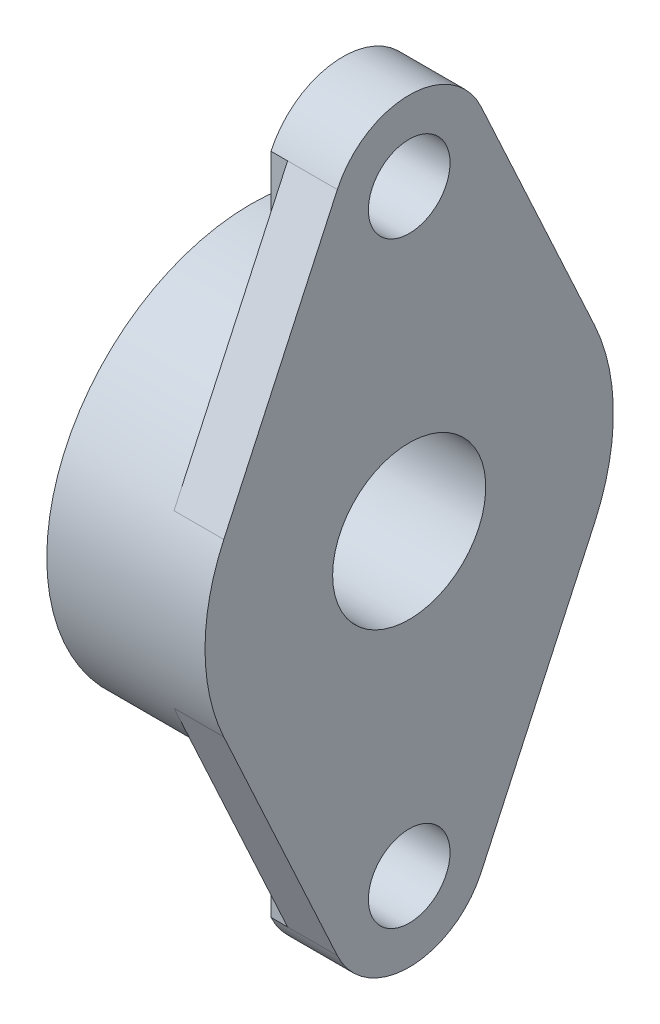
ISO-10303-21;
HEADER;
FILE_DESCRIPTION(('STEP AP214'),'2;1');
FILE_NAME('part.step','',(''),(''),'','','');
FILE_SCHEMA(('AUTOMOTIVE_DESIGN { 1 0 10303 214 1 1 1 1 }'));
ENDSEC;
DATA;
#1=APPLICATION_CONTEXT('core data for automotive mechanical design processes');
#2=APPLICATION_PROTOCOL_DEFINITION('international standard','automotive_design',2000,#1);
#3=PRODUCT_CONTEXT('',#1,'mechanical');
#4=PRODUCT('Part','Part','',(#3));
#5=PRODUCT_RELATED_PRODUCT_CATEGORY('part','',(#4));
#6=PRODUCT_DEFINITION_FORMATION('','',#4);
#7=PRODUCT_DEFINITION_CONTEXT('part definition',#1,'design');
#8=PRODUCT_DEFINITION('design','',#6,#7);
#9=PRODUCT_DEFINITION_SHAPE('','',#8);
#10=(LENGTH_UNIT() NAMED_UNIT(*) SI_UNIT(.MILLI.,.METRE.));
#11=(NAMED_UNIT(*) PLANE_ANGLE_UNIT() SI_UNIT($,.RADIAN.));
#12=(NAMED_UNIT(*) SI_UNIT($,.STERADIAN.) SOLID_ANGLE_UNIT());
#13=UNCERTAINTY_MEASURE_WITH_UNIT(LENGTH_MEASURE(1.E-05),#10,'distance_accuracy_value','');
#14=(GEOMETRIC_REPRESENTATION_CONTEXT(3) GLOBAL_UNCERTAINTY_ASSIGNED_CONTEXT((#13)) GLOBAL_UNIT_ASSIGNED_CONTEXT((#10,
#11,#12)) REPRESENTATION_CONTEXT('',''));
#15=CARTESIAN_POINT('',(0.,0.,0.));
#16=DIRECTION('',(0.,0.,1.));
#17=DIRECTION('',(1.,0.,0.));
#18=AXIS2_PLACEMENT_3D('',#15,#16,#17);
#19=CARTESIAN_POINT('',(-9.75,-65.2808668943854,-36.3230768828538));
#20=DIRECTION('',(-1.,0.,0.));
#21=DIRECTION('',(0.,0.,1.));
#22=AXIS2_PLACEMENT_3D('',#19,#20,#21);
#23=PLANE('',#22);
#24=DIRECTION('',(0.,-1.,0.));
#25=VECTOR('',#24,1.);
#26=CARTESIAN_POINT('',(-9.75,-51.2166303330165,-14.0751922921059));
#27=LINE('',#26,#25);
#28=CARTESIAN_POINT('',(-9.75,-37.4418076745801,-14.0751922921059));
#29=VERTEX_POINT('',#28);
#30=CARTESIAN_POINT('',(-9.75,-64.991452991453,-14.0751922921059));
#31=VERTEX_POINT('',#30);
#32=EDGE_CURVE('E71',#29,#31,#27,.T.);
#33=ORIENTED_EDGE('',*,*,#32,.F.);
#34=CARTESIAN_POINT('',(-9.75,0.,0.));
#35=DIRECTION('',(-1.,0.,0.));
#36=DIRECTION('',(0.,0.,1.));
#37=AXIS2_PLACEMENT_3D('',#34,#35,#36);
#38=CIRCLE('',#37,40.);
#39=CARTESIAN_POINT('',(-9.75,-16.7558025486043,-36.3213861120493));
#40=VERTEX_POINT('',#39);
#41=EDGE_CURVE('E208',#40,#29,#38,.T.);
#42=ORIENTED_EDGE('',*,*,#41,.F.);
#43=DIRECTION('',(0.,0.908076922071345,-0.418803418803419));
#44=VECTOR('',#43,1.);
#45=CARTESIAN_POINT('',(-9.75,-40.8717948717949,-25.1991345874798));
#46=LINE('',#45,#44);
#47=EDGE_CURVE('E308',#31,#40,#46,.T.);
#48=ORIENTED_EDGE('',*,*,#47,.F.);
#49=EDGE_LOOP('',(#33,#42,#48));
#50=FACE_BOUND('',#49,.T.);
#51=ADVANCED_FACE('F16',(#50),#23,.T.);
#52=CARTESIAN_POINT('',(-13.,-64.991452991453,-14.0751922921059));
#53=DIRECTION('',(0.,0.,-1.));
#54=DIRECTION('',(0.,1.,0.));
#55=AXIS2_PLACEMENT_3D('',#52,#53,#54);
#56=PLANE('',#55);
#57=DIRECTION('',(0.,-1.,0.));
#58=VECTOR('',#57,1.);
#59=CARTESIAN_POINT('',(-13.,-55.9036947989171,-14.0751922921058));
#60=LINE('',#59,#58);
#61=CARTESIAN_POINT('',(-13.,-37.4418076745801,-14.0751922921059));
#62=VERTEX_POINT('',#61);
#63=CARTESIAN_POINT('',(-13.,-64.991452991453,-14.0751922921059));
#64=VERTEX_POINT('',#63);
#65=EDGE_CURVE('E65',#62,#64,#60,.T.);
#66=ORIENTED_EDGE('',*,*,#65,.F.);
#67=DIRECTION('',(-1.,0.,0.));
#68=VECTOR('',#67,1.);
#69=CARTESIAN_POINT('',(-15.5,-37.4418076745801,-14.0751922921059));
#70=LINE('',#69,#68);
#71=EDGE_CURVE('E300',#29,#62,#70,.T.);
#72=ORIENTED_EDGE('',*,*,#71,.F.);
#73=ORIENTED_EDGE('',*,*,#32,.T.);
#74=DIRECTION('',(1.,0.,0.));
#75=VECTOR('',#74,1.);
#76=CARTESIAN_POINT('',(-6.5,-64.991452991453,-14.0751922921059));
#77=LINE('',#76,#75);
#78=EDGE_CURVE('E316',#64,#31,#77,.T.);
#79=ORIENTED_EDGE('',*,*,#78,.F.);
#80=EDGE_LOOP('',(#66,#72,#73,#79));
#81=FACE_BOUND('',#80,.T.);
#82=ADVANCED_FACE('F482',(#81),#56,.T.);
#83=CARTESIAN_POINT('',(-9.75,16.4663885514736,-36.3230768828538));
#84=DIRECTION('',(-1.,0.,0.));
#85=DIRECTION('',(0.,0.,1.));
#86=AXIS2_PLACEMENT_3D('',#83,#84,#85);
#87=PLANE('',#86);
#88=CARTESIAN_POINT('',(-9.75,0.,0.));
#89=DIRECTION('',(-1.,0.,0.));
#90=DIRECTION('',(0.,0.,1.));
#91=AXIS2_PLACEMENT_3D('',#88,#89,#90);
#92=CIRCLE('',#91,40.);
#93=CARTESIAN_POINT('',(-9.75,37.4418076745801,-14.0751922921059));
#94=VERTEX_POINT('',#93);
#95=CARTESIAN_POINT('',(-9.75,16.7558025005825,-36.3213861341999));
#96=VERTEX_POINT('',#95);
#97=EDGE_CURVE('E360',#94,#96,#92,.T.);
#98=ORIENTED_EDGE('',*,*,#97,.F.);
#99=DIRECTION('',(0.,-1.,0.));
#100=VECTOR('',#99,1.);
#101=CARTESIAN_POINT('',(-9.75,51.2166303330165,-14.0751922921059));
#102=LINE('',#101,#100);
#103=CARTESIAN_POINT('',(-9.75,64.991452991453,-14.0751922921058));
#104=VERTEX_POINT('',#103);
#105=EDGE_CURVE('E270',#104,#94,#102,.T.);
#106=ORIENTED_EDGE('',*,*,#105,.F.);
#107=DIRECTION('',(0.,0.908076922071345,0.418803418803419));
#108=VECTOR('',#107,1.);
#109=CARTESIAN_POINT('',(-9.75,40.8717948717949,-25.1991345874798));
#110=LINE('',#109,#108);
#111=EDGE_CURVE('E203',#96,#104,#110,.T.);
#112=ORIENTED_EDGE('',*,*,#111,.F.);
#113=EDGE_LOOP('',(#98,#106,#112));
#114=FACE_BOUND('',#113,.T.);
#115=ADVANCED_FACE('F371',(#114),#87,.T.);
#116=CARTESIAN_POINT('',(-13.,37.4418076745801,-14.0751922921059));
#117=DIRECTION('',(0.,0.,-1.));
#118=DIRECTION('',(0.,1.,0.));
#119=AXIS2_PLACEMENT_3D('',#116,#117,#118);
#120=PLANE('',#119);
#121=DIRECTION('',(0.,-1.,0.));
#122=VECTOR('',#121,1.);
#123=CARTESIAN_POINT('',(-13.,55.9036947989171,-14.0751922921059));
#124=LINE('',#123,#122);
#125=CARTESIAN_POINT('',(-13.,64.991452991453,-14.0751922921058));
#126=VERTEX_POINT('',#125);
#127=CARTESIAN_POINT('',(-13.,37.4418076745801,-14.0751922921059));
#128=VERTEX_POINT('',#127);
#129=EDGE_CURVE('E245',#126,#128,#124,.T.);
#130=ORIENTED_EDGE('',*,*,#129,.F.);
#131=DIRECTION('',(-1.,0.,0.));
#132=VECTOR('',#131,1.);
#133=CARTESIAN_POINT('',(-6.5,64.991452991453,-14.0751922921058));
#134=LINE('',#133,#132);
#135=EDGE_CURVE('E197',#104,#126,#134,.T.);
#136=ORIENTED_EDGE('',*,*,#135,.F.);
#137=ORIENTED_EDGE('',*,*,#105,.T.);
#138=DIRECTION('',(1.,0.,0.));
#139=VECTOR('',#138,1.);
#140=CARTESIAN_POINT('',(-15.5,37.4418076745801,-14.0751922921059));
#141=LINE('',#140,#139);
#142=EDGE_CURVE('E215',#128,#94,#141,.T.);
#143=ORIENTED_EDGE('',*,*,#142,.F.);
#144=EDGE_LOOP('',(#130,#136,#137,#143));
#145=FACE_BOUND('',#144,.T.);
#146=ADVANCED_FACE('F366',(#145),#120,.T.);
#147=CARTESIAN_POINT('',(-13.,-37.4418076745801,14.0751922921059));
#148=DIRECTION('',(0.,0.,1.));
#149=DIRECTION('',(0.,-1.,0.));
#150=AXIS2_PLACEMENT_3D('',#147,#148,#149);
#151=PLANE('',#150);
#152=DIRECTION('',(0.,1.,0.));
#153=VECTOR('',#152,1.);
#154=CARTESIAN_POINT('',(-13.,-55.9036947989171,14.0751922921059));
#155=LINE('',#154,#153);
#156=CARTESIAN_POINT('',(-13.,-64.991452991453,14.0751922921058));
#157=VERTEX_POINT('',#156);
#158=CARTESIAN_POINT('',(-13.,-37.4418076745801,14.0751922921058));
#159=VERTEX_POINT('',#158);
#160=EDGE_CURVE('E59',#157,#159,#155,.T.);
#161=ORIENTED_EDGE('',*,*,#160,.F.);
#162=DIRECTION('',(-1.,0.,0.));
#163=VECTOR('',#162,1.);
#164=CARTESIAN_POINT('',(-6.5,-64.991452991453,14.0751922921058));
#165=LINE('',#164,#163);
#166=CARTESIAN_POINT('',(-9.75,-64.991452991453,14.0751922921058));
#167=VERTEX_POINT('',#166);
#168=EDGE_CURVE('E257',#167,#157,#165,.T.);
#169=ORIENTED_EDGE('',*,*,#168,.F.);
#170=DIRECTION('',(0.,1.,0.));
#171=VECTOR('',#170,1.);
#172=CARTESIAN_POINT('',(-9.75,-64.991452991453,14.0751922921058));
#173=LINE('',#172,#171);
#174=CARTESIAN_POINT('',(-9.75,-37.4418076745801,14.0751922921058));
#175=VERTEX_POINT('',#174);
#176=EDGE_CURVE('E251',#175,#167,#173,.F.);
#177=ORIENTED_EDGE('',*,*,#176,.F.);
#178=DIRECTION('',(1.,0.,0.));
#179=VECTOR('',#178,1.);
#180=CARTESIAN_POINT('',(-15.5,-37.4418076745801,14.0751922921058));
#181=LINE('',#180,#179);
#182=EDGE_CURVE('E277',#159,#175,#181,.T.);
#183=ORIENTED_EDGE('',*,*,#182,.F.);
#184=EDGE_LOOP('',(#161,#169,#177,#183));
#185=FACE_BOUND('',#184,.T.);
#186=ADVANCED_FACE('F432',(#185),#151,.T.);
#187=CARTESIAN_POINT('',(-9.75,16.4663885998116,14.0751922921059));
#188=DIRECTION('',(-1.,0.,0.));
#189=DIRECTION('',(0.,0.,1.));
#190=AXIS2_PLACEMENT_3D('',#187,#188,#189);
#191=PLANE('',#190);
#192=DIRECTION('',(0.,1.,0.));
#193=VECTOR('',#192,1.);
#194=CARTESIAN_POINT('',(-9.75,51.2166303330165,14.0751922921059));
#195=LINE('',#194,#193);
#196=CARTESIAN_POINT('',(-9.75,37.4418076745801,14.0751922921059));
#197=VERTEX_POINT('',#196);
#198=CARTESIAN_POINT('',(-9.75,64.991452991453,14.0751922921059));
#199=VERTEX_POINT('',#198);
#200=EDGE_CURVE('E133',#197,#199,#195,.T.);
#201=ORIENTED_EDGE('',*,*,#200,.F.);
#202=CARTESIAN_POINT('',(-9.75,0.,0.));
#203=DIRECTION('',(-1.,0.,0.));
#204=DIRECTION('',(0.,0.,1.));
#205=AXIS2_PLACEMENT_3D('',#202,#203,#204);
#206=CIRCLE('',#205,40.);
#207=CARTESIAN_POINT('',(-9.75,16.7558025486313,36.3213861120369));
#208=VERTEX_POINT('',#207);
#209=EDGE_CURVE('E184',#208,#197,#206,.T.);
#210=ORIENTED_EDGE('',*,*,#209,.F.);
#211=DIRECTION('',(0.,-0.908076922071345,0.418803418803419));
#212=VECTOR('',#211,1.);
#213=CARTESIAN_POINT('',(-9.75,40.8717948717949,25.1991345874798));
#214=LINE('',#213,#212);
#215=EDGE_CURVE('E274',#199,#208,#214,.T.);
#216=ORIENTED_EDGE('',*,*,#215,.F.);
#217=EDGE_LOOP('',(#201,#210,#216));
#218=FACE_BOUND('',#217,.T.);
#219=ADVANCED_FACE('F420',(#218),#191,.T.);
#220=CARTESIAN_POINT('',(-13.,64.991452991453,14.0751922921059));
#221=DIRECTION('',(0.,0.,1.));
#222=DIRECTION('',(0.,-1.,0.));
#223=AXIS2_PLACEMENT_3D('',#220,#221,#222);
#224=PLANE('',#223);
#225=DIRECTION('',(0.,1.,0.));
#226=VECTOR('',#225,1.);
#227=CARTESIAN_POINT('',(-13.,55.9036947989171,14.0751922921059));
#228=LINE('',#227,#226);
#229=CARTESIAN_POINT('',(-13.,37.4418076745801,14.0751922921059));
#230=VERTEX_POINT('',#229);
#231=CARTESIAN_POINT('',(-13.,64.991452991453,14.0751922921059));
#232=VERTEX_POINT('',#231);
#233=EDGE_CURVE('E128',#230,#232,#228,.T.);
#234=ORIENTED_EDGE('',*,*,#233,.F.);
#235=DIRECTION('',(-1.,0.,0.));
#236=VECTOR('',#235,1.);
#237=CARTESIAN_POINT('',(-15.5,37.4418076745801,14.0751922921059));
#238=LINE('',#237,#236);
#239=EDGE_CURVE('E267',#197,#230,#238,.T.);
#240=ORIENTED_EDGE('',*,*,#239,.F.);
#241=ORIENTED_EDGE('',*,*,#200,.T.);
#242=DIRECTION('',(1.,0.,0.));
#243=VECTOR('',#242,1.);
#244=CARTESIAN_POINT('',(-6.5,64.991452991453,14.0751922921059));
#245=LINE('',#244,#243);
#246=EDGE_CURVE('E284',#232,#199,#245,.T.);
#247=ORIENTED_EDGE('',*,*,#246,.F.);
#248=EDGE_LOOP('',(#234,#240,#241,#247));
#249=FACE_BOUND('',#248,.T.);
#250=ADVANCED_FACE('F424',(#249),#224,.T.);
#251=CARTESIAN_POINT('',(-9.75,-65.2808668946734,14.0751922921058));
#252=DIRECTION('',(-1.,0.,0.));
#253=DIRECTION('',(0.,0.,1.));
#254=AXIS2_PLACEMENT_3D('',#251,#252,#253);
#255=PLANE('',#254);
#256=CARTESIAN_POINT('',(-9.75,0.,0.));
#257=DIRECTION('',(-1.,0.,0.));
#258=DIRECTION('',(0.,0.,1.));
#259=AXIS2_PLACEMENT_3D('',#256,#257,#258);
#260=CIRCLE('',#259,40.);
#261=CARTESIAN_POINT('',(-9.75,-16.7558025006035,36.3213861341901));
#262=VERTEX_POINT('',#261);
#263=EDGE_CURVE('E154',#175,#262,#260,.T.);
#264=ORIENTED_EDGE('',*,*,#263,.F.);
#265=ORIENTED_EDGE('',*,*,#176,.T.);
#266=DIRECTION('',(0.,-0.908076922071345,-0.418803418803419));
#267=VECTOR('',#266,1.);
#268=CARTESIAN_POINT('',(-9.75,-40.8717948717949,25.1991345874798));
#269=LINE('',#268,#267);
#270=EDGE_CURVE('E171',#262,#167,#269,.T.);
#271=ORIENTED_EDGE('',*,*,#270,.F.);
#272=EDGE_LOOP('',(#264,#265,#271));
#273=FACE_BOUND('',#272,.T.);
#274=ADVANCED_FACE('F238',(#273),#255,.T.);
#275=CARTESIAN_POINT('',(-13.,37.4418076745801,14.0751922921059));
#276=CARTESIAN_POINT('',(-13.,74.,14.0751922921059));
#277=CARTESIAN_POINT('',(-13.,74.3655819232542,14.0751922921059));
#278=B_SPLINE_CURVE_WITH_KNOTS('',1,(#275,#276,#277),.UNSPECIFIED.,.F.,.F.,(2,1,2),(0.,1.,1.01),.UNSPECIFIED.);
#279=DIRECTION('',(0.,0.,-1.));
#280=VECTOR('',#279,1.);
#281=SURFACE_OF_LINEAR_EXTRUSION('',#278,#280);
#282=CARTESIAN_POINT('',(-13.,58.5,0.));
#283=DIRECTION('',(1.,0.,0.));
#284=DIRECTION('',(0.,0.,-1.));
#285=AXIS2_PLACEMENT_3D('',#282,#283,#284);
#286=CIRCLE('',#285,8.);
#287=CARTESIAN_POINT('',(-13.,58.5,-8.));
#288=VERTEX_POINT('',#287);
#289=EDGE_CURVE('E165',#288,#288,#286,.F.);
#290=ORIENTED_EDGE('',*,*,#289,.F.);
#291=EDGE_LOOP('',(#290));
#292=FACE_BOUND('',#291,.T.);
#293=ORIENTED_EDGE('',*,*,#129,.T.);
#294=CARTESIAN_POINT('',(-13.,0.,0.));
#295=DIRECTION('',(-1.,0.,0.));
#296=DIRECTION('',(0.,0.,1.));
#297=AXIS2_PLACEMENT_3D('',#294,#295,#296);
#298=CIRCLE('',#297,40.);
#299=EDGE_CURVE('E261',#230,#128,#298,.T.);
#300=ORIENTED_EDGE('',*,*,#299,.F.);
#301=ORIENTED_EDGE('',*,*,#233,.T.);
#302=CARTESIAN_POINT('',(-13.,58.5,0.));
#303=DIRECTION('',(1.,0.,0.));
#304=DIRECTION('',(0.,0.,-1.));
#305=AXIS2_PLACEMENT_3D('',#302,#303,#304);
#306=CIRCLE('',#305,15.5);
#307=EDGE_CURVE('E288',#126,#232,#306,.T.);
#308=ORIENTED_EDGE('',*,*,#307,.F.);
#309=EDGE_LOOP('',(#293,#300,#301,#308));
#310=FACE_BOUND('',#309,.T.);
#311=ADVANCED_FACE('F232',(#292,#310),#281,.T.);
#312=CARTESIAN_POINT('',(-13.,-74.3655819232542,14.0751922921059));
#313=CARTESIAN_POINT('',(-13.,-74.,14.0751922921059));
#314=CARTESIAN_POINT('',(-13.,-37.44180767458,14.0751922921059));
#315=B_SPLINE_CURVE_WITH_KNOTS('',1,(#312,#313,#314),.UNSPECIFIED.,.F.,.F.,(2,1,2),(-0.01,0.,
1.),.UNSPECIFIED.);
#316=DIRECTION('',(0.,0.,-1.));
#317=VECTOR('',#316,1.);
#318=SURFACE_OF_LINEAR_EXTRUSION('',#315,#317);
#319=CARTESIAN_POINT('',(-13.,-58.5,0.));
#320=DIRECTION('',(1.,0.,0.));
#321=DIRECTION('',(0.,0.,-1.));
#322=AXIS2_PLACEMENT_3D('',#319,#320,#321);
#323=CIRCLE('',#322,8.);
#324=CARTESIAN_POINT('',(-13.,-58.5,-8.));
#325=VERTEX_POINT('',#324);
#326=EDGE_CURVE('E169',#325,#325,#323,.F.);
#327=ORIENTED_EDGE('',*,*,#326,.F.);
#328=EDGE_LOOP('',(#327));
#329=FACE_BOUND('',#328,.T.);
#330=ORIENTED_EDGE('',*,*,#65,.T.);
#331=CARTESIAN_POINT('',(-13.,-58.5,0.));
#332=DIRECTION('',(1.,0.,0.));
#333=DIRECTION('',(0.,0.,-1.));
#334=AXIS2_PLACEMENT_3D('',#331,#332,#333);
#335=CIRCLE('',#334,15.5);
#336=EDGE_CURVE('E19',#157,#64,#335,.T.);
#337=ORIENTED_EDGE('',*,*,#336,.F.);
#338=ORIENTED_EDGE('',*,*,#160,.T.);
#339=CARTESIAN_POINT('',(-13.,0.,0.));
#340=DIRECTION('',(-1.,0.,0.));
#341=DIRECTION('',(0.,0.,1.));
#342=AXIS2_PLACEMENT_3D('',#339,#340,#341);
#343=CIRCLE('',#342,40.);
#344=EDGE_CURVE('E353',#62,#159,#343,.T.);
#345=ORIENTED_EDGE('',*,*,#344,.F.);
#346=EDGE_LOOP('',(#330,#337,#338,#345));
#347=FACE_BOUND('',#346,.T.);
#348=ADVANCED_FACE('F227',(#329,#347),#318,.T.);
#349=CARTESIAN_POINT('',(-31.,-40.,40.4800021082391));
#350=DIRECTION('',(-1.,0.,0.));
#351=DIRECTION('',(0.,1.,0.));
#352=AXIS2_PLACEMENT_3D('',#349,#350,#351);
#353=PLANE('',#352);
#354=CARTESIAN_POINT('',(-31.,0.,0.));
#355=DIRECTION('',(-1.,0.,0.));
#356=DIRECTION('',(0.,0.,1.));
#357=AXIS2_PLACEMENT_3D('',#354,#355,#356);
#358=CIRCLE('',#357,22.5);
#359=CARTESIAN_POINT('',(-31.,0.,22.5));
#360=VERTEX_POINT('',#359);
#361=EDGE_CURVE('E344',#360,#360,#358,.T.);
#362=ORIENTED_EDGE('',*,*,#361,.F.);
#363=EDGE_LOOP('',(#362));
#364=FACE_BOUND('',#363,.T.);
#365=CARTESIAN_POINT('',(-31.,0.,0.));
#366=DIRECTION('',(-1.,0.,0.));
#367=DIRECTION('',(0.,0.,1.));
#368=AXIS2_PLACEMENT_3D('',#365,#366,#367);
#369=CIRCLE('',#368,40.);
#370=CARTESIAN_POINT('',(-31.,0.,40.));
#371=VERTEX_POINT('',#370);
#372=EDGE_CURVE('E190',#371,#371,#369,.F.);
#373=ORIENTED_EDGE('',*,*,#372,.F.);
#374=EDGE_LOOP('',(#373));
#375=FACE_BOUND('',#374,.T.);
#376=ADVANCED_FACE('F231',(#364,#375),#353,.T.);
#377=CARTESIAN_POINT('',(0.,-58.5,0.));
#378=DIRECTION('',(1.,0.,0.));
#379=DIRECTION('',(0.,0.,-1.));
#380=AXIS2_PLACEMENT_3D('',#377,#378,#379);
#381=CYLINDRICAL_SURFACE('',#380,15.5);
#382=ORIENTED_EDGE('',*,*,#336,.T.);
#383=ORIENTED_EDGE('',*,*,#78,.T.);
#384=DIRECTION('',(1.,0.,0.));
#385=VECTOR('',#384,1.);
#386=CARTESIAN_POINT('',(-9.75,-64.991452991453,-14.0751922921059));
#387=LINE('',#386,#385);
#388=CARTESIAN_POINT('',(0.,-64.991452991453,-14.0751922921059));
#389=VERTEX_POINT('',#388);
#390=EDGE_CURVE('E212',#389,#31,#387,.F.);
#391=ORIENTED_EDGE('',*,*,#390,.F.);
#392=CARTESIAN_POINT('',(0.,-58.5,0.));
#393=DIRECTION('',(1.,0.,0.));
#394=DIRECTION('',(0.,0.,-1.));
#395=AXIS2_PLACEMENT_3D('',#392,#393,#394);
#396=CIRCLE('',#395,15.5);
#397=CARTESIAN_POINT('',(0.,-64.991452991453,14.0751922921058));
#398=VERTEX_POINT('',#397);
#399=EDGE_CURVE('E341',#398,#389,#396,.T.);
#400=ORIENTED_EDGE('',*,*,#399,.F.);
#401=DIRECTION('',(1.,0.,0.));
#402=VECTOR('',#401,1.);
#403=CARTESIAN_POINT('',(-9.75,-64.991452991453,14.0751922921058));
#404=LINE('',#403,#402);
#405=EDGE_CURVE('E166',#167,#398,#404,.T.);
#406=ORIENTED_EDGE('',*,*,#405,.F.);
#407=ORIENTED_EDGE('',*,*,#168,.T.);
#408=EDGE_LOOP('',(#382,#383,#391,#400,#406,#407));
#409=FACE_BOUND('',#408,.T.);
#410=ADVANCED_FACE('F454',(#409),#381,.T.);
#411=CARTESIAN_POINT('',(-9.75,-64.991452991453,-14.0751922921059));
#412=DIRECTION('',(0.,-0.418803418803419,-0.908076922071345));
#413=DIRECTION('',(0.,0.908076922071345,-0.418803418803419));
#414=AXIS2_PLACEMENT_3D('',#411,#412,#413);
#415=PLANE('',#414);
#416=CARTESIAN_POINT('',(0.,-64.991452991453,-14.0751922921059));
#417=CARTESIAN_POINT('',(0.,-62.9814814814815,-15.002187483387));
#418=CARTESIAN_POINT('',(0.,-60.97150997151,-15.9291826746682));
#419=CARTESIAN_POINT('',(0.,-56.9515669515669,-17.7831730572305));
#420=CARTESIAN_POINT('',(0.,-54.9415954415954,-18.7101682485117));
#421=CARTESIAN_POINT('',(0.,-50.9216524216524,-20.564158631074));
#422=CARTESIAN_POINT('',(0.,-48.9116809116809,-21.4911538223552));
#423=CARTESIAN_POINT('',(0.,-44.8917378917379,-23.3451442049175));
#424=CARTESIAN_POINT('',(0.,-42.8817663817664,-24.2721393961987));
#425=CARTESIAN_POINT('',(0.,-38.8618233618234,-26.126129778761));
#426=CARTESIAN_POINT('',(0.,-36.8518518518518,-27.0531249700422));
#427=CARTESIAN_POINT('',(0.,-32.8319088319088,-28.9071153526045));
#428=CARTESIAN_POINT('',(0.,-30.8219373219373,-29.8341105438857));
#429=CARTESIAN_POINT('',(0.,-26.8019943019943,-31.688100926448));
#430=CARTESIAN_POINT('',(0.,-24.7920227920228,-32.6150961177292));
#431=CARTESIAN_POINT('',(0.,-20.7720797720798,-34.4690865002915));
#432=CARTESIAN_POINT('',(0.,-18.7621082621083,-35.3960816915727));
#433=CARTESIAN_POINT('',(0.,-16.7521367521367,-36.3230768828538));
#434=B_SPLINE_CURVE_WITH_KNOTS('',3,(#416,#417,#418,#419,#420,#421,#422,#423,#424,#425,#426,
#427,#428,#429,#430,#431,#432,#433),.UNSPECIFIED.,.F.,.F.,(4,2,2,2,2,2,2,2,4),(0.,
6.64031249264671,13.2806249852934,19.9209374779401,26.5612499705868,33.2015624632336,
39.8418749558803,46.482187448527,53.1224999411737),.UNSPECIFIED.);
#435=CARTESIAN_POINT('',(0.,-16.7521367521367,-36.3230768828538));
#436=VERTEX_POINT('',#435);
#437=EDGE_CURVE('E340',#389,#436,#434,.T.);
#438=ORIENTED_EDGE('',*,*,#437,.F.);
#439=ORIENTED_EDGE('',*,*,#390,.T.);
#440=ORIENTED_EDGE('',*,*,#47,.T.);
#441=CARTESIAN_POINT('',(-9.75,-16.7521367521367,-36.3230768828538));
#442=VERTEX_POINT('',#441);
#443=EDGE_CURVE('E34',#40,#442,#46,.T.);
#444=ORIENTED_EDGE('',*,*,#443,.T.);
#445=DIRECTION('',(-1.,0.,0.));
#446=VECTOR('',#445,1.);
#447=CARTESIAN_POINT('',(-15.5,-16.7521367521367,-36.3230768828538));
#448=LINE('',#447,#446);
#449=EDGE_CURVE('E206',#436,#442,#448,.T.);
#450=ORIENTED_EDGE('',*,*,#449,.F.);
#451=EDGE_LOOP('',(#438,#439,#440,#444,#450));
#452=FACE_BOUND('',#451,.T.);
#453=ADVANCED_FACE('F472',(#452),#415,.T.);
#454=CARTESIAN_POINT('',(-9.75,16.7521367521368,-36.3230768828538));
#455=DIRECTION('',(0.,0.418803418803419,-0.908076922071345));
#456=DIRECTION('',(0.,0.908076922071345,0.418803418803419));
#457=AXIS2_PLACEMENT_3D('',#454,#455,#456);
#458=PLANE('',#457);
#459=CARTESIAN_POINT('',(0.,16.7521367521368,-36.3230768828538));
#460=CARTESIAN_POINT('',(0.,18.7621082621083,-35.3960816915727));
#461=CARTESIAN_POINT('',(0.,20.7720797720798,-34.4690865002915));
#462=CARTESIAN_POINT('',(0.,24.7920227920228,-32.6150961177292));
#463=CARTESIAN_POINT('',(0.,26.8019943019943,-31.688100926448));
#464=CARTESIAN_POINT('',(0.,30.8219373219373,-29.8341105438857));
#465=CARTESIAN_POINT('',(0.,32.8319088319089,-28.9071153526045));
#466=CARTESIAN_POINT('',(0.,36.8518518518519,-27.0531249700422));
#467=CARTESIAN_POINT('',(0.,38.8618233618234,-26.126129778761));
#468=CARTESIAN_POINT('',(0.,42.8817663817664,-24.2721393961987));
#469=CARTESIAN_POINT('',(0.,44.8917378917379,-23.3451442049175));
#470=CARTESIAN_POINT('',(0.,48.9116809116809,-21.4911538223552));
#471=CARTESIAN_POINT('',(0.,50.9216524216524,-20.564158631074));
#472=CARTESIAN_POINT('',(0.,54.9415954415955,-18.7101682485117));
#473=CARTESIAN_POINT('',(0.,56.951566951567,-17.7831730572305));
#474=CARTESIAN_POINT('',(0.,60.97150997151,-15.9291826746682));
#475=CARTESIAN_POINT('',(0.,62.9814814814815,-15.002187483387));
#476=CARTESIAN_POINT('',(0.,64.991452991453,-14.0751922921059));
#477=B_SPLINE_CURVE_WITH_KNOTS('',3,(#459,#460,#461,#462,#463,#464,#465,#466,#467,#468,#469,
#470,#471,#472,#473,#474,#475,#476),.UNSPECIFIED.,.F.,.F.,(4,2,2,2,2,2,2,2,4),(0.,
6.64031249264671,13.2806249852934,19.9209374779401,26.5612499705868,33.2015624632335,
39.8418749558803,46.482187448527,53.1224999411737),.UNSPECIFIED.);
#478=CARTESIAN_POINT('',(0.,16.7521367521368,-36.3230768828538));
#479=VERTEX_POINT('',#478);
#480=CARTESIAN_POINT('',(0.,64.991452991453,-14.0751922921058));
#481=VERTEX_POINT('',#480);
#482=EDGE_CURVE('E336',#479,#481,#477,.T.);
#483=ORIENTED_EDGE('',*,*,#482,.F.);
#484=DIRECTION('',(1.,0.,0.));
#485=VECTOR('',#484,1.);
#486=CARTESIAN_POINT('',(-9.75,16.7521367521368,-36.3230768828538));
#487=LINE('',#486,#485);
#488=CARTESIAN_POINT('',(-9.75,16.7521367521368,-36.3230768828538));
#489=VERTEX_POINT('',#488);
#490=EDGE_CURVE('E198',#479,#489,#487,.F.);
#491=ORIENTED_EDGE('',*,*,#490,.T.);
#492=CARTESIAN_POINT('',(-9.75,0.,0.));
#493=DIRECTION('',(-1.,0.,0.));
#494=DIRECTION('',(0.,1.,0.));
#495=AXIS2_PLACEMENT_3D('',#492,#493,#494);
#496=CIRCLE('',#495,40.);
#497=EDGE_CURVE('E209',#96,#489,#496,.T.);
#498=ORIENTED_EDGE('',*,*,#497,.F.);
#499=ORIENTED_EDGE('',*,*,#111,.T.);
#500=DIRECTION('',(-1.,0.,0.));
#501=VECTOR('',#500,1.);
#502=CARTESIAN_POINT('',(-6.5,64.991452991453,-14.0751922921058));
#503=LINE('',#502,#501);
#504=EDGE_CURVE('E194',#481,#104,#503,.T.);
#505=ORIENTED_EDGE('',*,*,#504,.F.);
#506=EDGE_LOOP('',(#483,#491,#498,#499,#505));
#507=FACE_BOUND('',#506,.T.);
#508=ADVANCED_FACE('F374',(#507),#458,.T.);
#509=CARTESIAN_POINT('',(0.,58.5,0.));
#510=DIRECTION('',(1.,0.,0.));
#511=DIRECTION('',(0.,0.,-1.));
#512=AXIS2_PLACEMENT_3D('',#509,#510,#511);
#513=CYLINDRICAL_SURFACE('',#512,15.5);
#514=ORIENTED_EDGE('',*,*,#307,.T.);
#515=ORIENTED_EDGE('',*,*,#246,.T.);
#516=DIRECTION('',(1.,0.,0.));
#517=VECTOR('',#516,1.);
#518=CARTESIAN_POINT('',(-9.75,64.991452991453,14.0751922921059));
#519=LINE('',#518,#517);
#520=CARTESIAN_POINT('',(0.,64.991452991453,14.0751922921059));
#521=VERTEX_POINT('',#520);
#522=EDGE_CURVE('E187',#521,#199,#519,.F.);
#523=ORIENTED_EDGE('',*,*,#522,.F.);
#524=CARTESIAN_POINT('',(0.,58.5,0.));
#525=DIRECTION('',(1.,0.,0.));
#526=DIRECTION('',(0.,0.,-1.));
#527=AXIS2_PLACEMENT_3D('',#524,#525,#526);
#528=CIRCLE('',#527,15.5);
#529=EDGE_CURVE('E333',#481,#521,#528,.T.);
#530=ORIENTED_EDGE('',*,*,#529,.F.);
#531=ORIENTED_EDGE('',*,*,#504,.T.);
#532=ORIENTED_EDGE('',*,*,#135,.T.);
#533=EDGE_LOOP('',(#514,#515,#523,#530,#531,#532));
#534=FACE_BOUND('',#533,.T.);
#535=ADVANCED_FACE('F423',(#534),#513,.T.);
#536=CARTESIAN_POINT('',(-9.75,64.991452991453,14.0751922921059));
#537=DIRECTION('',(0.,0.418803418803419,0.908076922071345));
#538=DIRECTION('',(0.,-0.908076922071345,0.418803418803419));
#539=AXIS2_PLACEMENT_3D('',#536,#537,#538);
#540=PLANE('',#539);
#541=CARTESIAN_POINT('',(0.,64.991452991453,14.0751922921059));
#542=CARTESIAN_POINT('',(0.,62.9814814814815,15.002187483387));
#543=CARTESIAN_POINT('',(0.,60.97150997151,15.9291826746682));
#544=CARTESIAN_POINT('',(0.,56.951566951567,17.7831730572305));
#545=CARTESIAN_POINT('',(0.,54.9415954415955,18.7101682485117));
#546=CARTESIAN_POINT('',(0.,50.9216524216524,20.564158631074));
#547=CARTESIAN_POINT('',(0.,48.9116809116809,21.4911538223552));
#548=CARTESIAN_POINT('',(0.,44.8917378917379,23.3451442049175));
#549=CARTESIAN_POINT('',(0.,42.8817663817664,24.2721393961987));
#550=CARTESIAN_POINT('',(0.,38.8618233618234,26.126129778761));
#551=CARTESIAN_POINT('',(0.,36.8518518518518,27.0531249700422));
#552=CARTESIAN_POINT('',(0.,32.8319088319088,28.9071153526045));
#553=CARTESIAN_POINT('',(0.,30.8219373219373,29.8341105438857));
#554=CARTESIAN_POINT('',(0.,26.8019943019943,31.688100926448));
#555=CARTESIAN_POINT('',(0.,24.7920227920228,32.6150961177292));
#556=CARTESIAN_POINT('',(0.,20.7720797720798,34.4690865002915));
#557=CARTESIAN_POINT('',(0.,18.7621082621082,35.3960816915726));
#558=CARTESIAN_POINT('',(0.,16.7521367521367,36.3230768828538));
#559=B_SPLINE_CURVE_WITH_KNOTS('',3,(#541,#542,#543,#544,#545,#546,#547,#548,#549,#550,#551,
#552,#553,#554,#555,#556,#557,#558),.UNSPECIFIED.,.F.,.F.,(4,2,2,2,2,2,2,2,4),(0.,
6.64031249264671,13.2806249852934,19.9209374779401,26.5612499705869,33.2015624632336,
39.8418749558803,46.482187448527,53.1224999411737),.UNSPECIFIED.);
#560=CARTESIAN_POINT('',(0.,16.7521367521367,36.3230768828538));
#561=VERTEX_POINT('',#560);
#562=EDGE_CURVE('E332',#521,#561,#559,.T.);
#563=ORIENTED_EDGE('',*,*,#562,.F.);
#564=ORIENTED_EDGE('',*,*,#522,.T.);
#565=ORIENTED_EDGE('',*,*,#215,.T.);
#566=CARTESIAN_POINT('',(-9.75,16.7521367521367,36.3230768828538));
#567=VERTEX_POINT('',#566);
#568=EDGE_CURVE('E191',#208,#567,#214,.T.);
#569=ORIENTED_EDGE('',*,*,#568,.T.);
#570=DIRECTION('',(-1.,0.,0.));
#571=VECTOR('',#570,1.);
#572=CARTESIAN_POINT('',(-15.5,16.7521367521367,36.3230768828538));
#573=LINE('',#572,#571);
#574=EDGE_CURVE('E158',#561,#567,#573,.T.);
#575=ORIENTED_EDGE('',*,*,#574,.F.);
#576=EDGE_LOOP('',(#563,#564,#565,#569,#575));
#577=FACE_BOUND('',#576,.T.);
#578=ADVANCED_FACE('F417',(#577),#540,.T.);
#579=CARTESIAN_POINT('',(-31.,0.,0.));
#580=DIRECTION('',(-1.,0.,0.));
#581=DIRECTION('',(0.,0.,1.));
#582=AXIS2_PLACEMENT_3D('',#579,#580,#581);
#583=CYLINDRICAL_SURFACE('',#582,40.);
#584=ORIENTED_EDGE('',*,*,#372,.T.);
#585=EDGE_LOOP('',(#584));
#586=FACE_BOUND('',#585,.T.);
#587=ORIENTED_EDGE('',*,*,#239,.T.);
#588=ORIENTED_EDGE('',*,*,#299,.T.);
#589=ORIENTED_EDGE('',*,*,#142,.T.);
#590=ORIENTED_EDGE('',*,*,#97,.T.);
#591=ORIENTED_EDGE('',*,*,#497,.T.);
#592=ORIENTED_EDGE('',*,*,#490,.F.);
#593=CARTESIAN_POINT('',(0.,0.,0.));
#594=DIRECTION('',(-1.,0.,0.));
#595=DIRECTION('',(0.,0.,1.));
#596=AXIS2_PLACEMENT_3D('',#593,#594,#595);
#597=CIRCLE('',#596,40.);
#598=EDGE_CURVE('E337',#436,#479,#597,.F.);
#599=ORIENTED_EDGE('',*,*,#598,.F.);
#600=ORIENTED_EDGE('',*,*,#449,.T.);
#601=ORIENTED_EDGE('',*,*,#443,.F.);
#602=ORIENTED_EDGE('',*,*,#41,.T.);
#603=ORIENTED_EDGE('',*,*,#71,.T.);
#604=ORIENTED_EDGE('',*,*,#344,.T.);
#605=ORIENTED_EDGE('',*,*,#182,.T.);
#606=ORIENTED_EDGE('',*,*,#263,.T.);
#607=CARTESIAN_POINT('',(-9.75,0.,0.));
#608=DIRECTION('',(-1.,0.,0.));
#609=DIRECTION('',(0.,1.,0.));
#610=AXIS2_PLACEMENT_3D('',#607,#608,#609);
#611=CIRCLE('',#610,40.);
#612=CARTESIAN_POINT('',(-9.75,-16.7521367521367,36.3230768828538));
#613=VERTEX_POINT('',#612);
#614=EDGE_CURVE('E145',#262,#613,#611,.T.);
#615=ORIENTED_EDGE('',*,*,#614,.T.);
#616=DIRECTION('',(1.,0.,0.));
#617=VECTOR('',#616,1.);
#618=CARTESIAN_POINT('',(-9.75,-16.7521367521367,36.3230768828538));
#619=LINE('',#618,#617);
#620=CARTESIAN_POINT('',(0.,-16.7521367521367,36.3230768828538));
#621=VERTEX_POINT('',#620);
#622=EDGE_CURVE('E150',#621,#613,#619,.F.);
#623=ORIENTED_EDGE('',*,*,#622,.F.);
#624=CARTESIAN_POINT('',(0.,0.,0.));
#625=DIRECTION('',(-1.,0.,0.));
#626=DIRECTION('',(0.,0.,1.));
#627=AXIS2_PLACEMENT_3D('',#624,#625,#626);
#628=CIRCLE('',#627,40.);
#629=EDGE_CURVE('E330',#561,#621,#628,.F.);
#630=ORIENTED_EDGE('',*,*,#629,.F.);
#631=ORIENTED_EDGE('',*,*,#574,.T.);
#632=ORIENTED_EDGE('',*,*,#568,.F.);
#633=ORIENTED_EDGE('',*,*,#209,.T.);
#634=EDGE_LOOP('',(#587,#588,#589,#590,#591,#592,#599,#600,#601,#602,#603,#604,#605,#606,#615,
#623,#630,#631,#632,#633));
#635=FACE_BOUND('',#634,.T.);
#636=ADVANCED_FACE('F148',(#586,#635),#583,.T.);
#637=CARTESIAN_POINT('',(-9.75,-16.7521367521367,36.3230768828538));
#638=DIRECTION('',(0.,-0.418803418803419,0.908076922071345));
#639=DIRECTION('',(0.,-0.908076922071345,-0.418803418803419));
#640=AXIS2_PLACEMENT_3D('',#637,#638,#639);
#641=PLANE('',#640);
#642=CARTESIAN_POINT('',(0.,-16.7521367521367,36.3230768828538));
#643=CARTESIAN_POINT('',(0.,-18.7621082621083,35.3960816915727));
#644=CARTESIAN_POINT('',(0.,-20.7720797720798,34.4690865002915));
#645=CARTESIAN_POINT('',(0.,-24.7920227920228,32.6150961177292));
#646=CARTESIAN_POINT('',(0.,-26.8019943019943,31.688100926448));
#647=CARTESIAN_POINT('',(0.,-30.8219373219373,29.8341105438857));
#648=CARTESIAN_POINT('',(0.,-32.8319088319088,28.9071153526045));
#649=CARTESIAN_POINT('',(0.,-36.8518518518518,27.0531249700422));
#650=CARTESIAN_POINT('',(0.,-38.8618233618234,26.126129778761));
#651=CARTESIAN_POINT('',(0.,-42.8817663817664,24.2721393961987));
#652=CARTESIAN_POINT('',(0.,-44.8917378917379,23.3451442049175));
#653=CARTESIAN_POINT('',(0.,-48.9116809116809,21.4911538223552));
#654=CARTESIAN_POINT('',(0.,-50.9216524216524,20.564158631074));
#655=CARTESIAN_POINT('',(0.,-54.9415954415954,18.7101682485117));
#656=CARTESIAN_POINT('',(0.,-56.951566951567,17.7831730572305));
#657=CARTESIAN_POINT('',(0.,-60.97150997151,15.9291826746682));
#658=CARTESIAN_POINT('',(0.,-62.9814814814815,15.002187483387));
#659=CARTESIAN_POINT('',(0.,-64.991452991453,14.0751922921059));
#660=B_SPLINE_CURVE_WITH_KNOTS('',3,(#642,#643,#644,#645,#646,#647,#648,#649,#650,#651,#652,
#653,#654,#655,#656,#657,#658,#659),.UNSPECIFIED.,.F.,.F.,(4,2,2,2,2,2,2,2,4),(0.,
6.64031249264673,13.2806249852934,19.9209374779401,26.5612499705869,33.2015624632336,
39.8418749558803,46.482187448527,53.1224999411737),.UNSPECIFIED.);
#661=EDGE_CURVE('E163',#621,#398,#660,.T.);
#662=ORIENTED_EDGE('',*,*,#661,.F.);
#663=ORIENTED_EDGE('',*,*,#622,.T.);
#664=ORIENTED_EDGE('',*,*,#614,.F.);
#665=ORIENTED_EDGE('',*,*,#270,.T.);
#666=ORIENTED_EDGE('',*,*,#405,.T.);
#667=EDGE_LOOP('',(#662,#663,#664,#665,#666));
#668=FACE_BOUND('',#667,.T.);
#669=ADVANCED_FACE('F160',(#668),#641,.T.);
#670=CARTESIAN_POINT('',(-13.,58.5,0.));
#671=DIRECTION('',(1.,0.,0.));
#672=DIRECTION('',(0.,0.,-1.));
#673=AXIS2_PLACEMENT_3D('',#670,#671,#672);
#674=CYLINDRICAL_SURFACE('',#673,8.);
#675=CARTESIAN_POINT('',(0.,58.5,0.));
#676=DIRECTION('',(1.,0.,0.));
#677=DIRECTION('',(0.,0.,-1.));
#678=AXIS2_PLACEMENT_3D('',#675,#676,#677);
#679=CIRCLE('',#678,8.);
#680=CARTESIAN_POINT('',(0.,58.5,-8.));
#681=VERTEX_POINT('',#680);
#682=EDGE_CURVE('E327',#681,#681,#679,.F.);
#683=ORIENTED_EDGE('',*,*,#682,.F.);
#684=EDGE_LOOP('',(#683));
#685=FACE_BOUND('',#684,.T.);
#686=ORIENTED_EDGE('',*,*,#289,.T.);
#687=EDGE_LOOP('',(#686));
#688=FACE_BOUND('',#687,.T.);
#689=ADVANCED_FACE('F463',(#685,#688),#674,.F.);
#690=CARTESIAN_POINT('',(-13.,-58.5,0.));
#691=DIRECTION('',(1.,0.,0.));
#692=DIRECTION('',(0.,0.,-1.));
#693=AXIS2_PLACEMENT_3D('',#690,#691,#692);
#694=CYLINDRICAL_SURFACE('',#693,8.);
#695=CARTESIAN_POINT('',(0.,-58.5,0.));
#696=DIRECTION('',(1.,0.,0.));
#697=DIRECTION('',(0.,0.,-1.));
#698=AXIS2_PLACEMENT_3D('',#695,#696,#697);
#699=CIRCLE('',#698,8.);
#700=CARTESIAN_POINT('',(0.,-58.5,-8.));
#701=VERTEX_POINT('',#700);
#702=EDGE_CURVE('E324',#701,#701,#699,.F.);
#703=ORIENTED_EDGE('',*,*,#702,.F.);
#704=EDGE_LOOP('',(#703));
#705=FACE_BOUND('',#704,.T.);
#706=ORIENTED_EDGE('',*,*,#326,.T.);
#707=EDGE_LOOP('',(#706));
#708=FACE_BOUND('',#707,.T.);
#709=ADVANCED_FACE('F449',(#705,#708),#694,.F.);
#710=CARTESIAN_POINT('',(-40.2,0.,0.));
#711=DIRECTION('',(-1.,0.,0.));
#712=DIRECTION('',(0.,0.,1.));
#713=AXIS2_PLACEMENT_3D('',#710,#711,#712);
#714=CYLINDRICAL_SURFACE('',#713,22.5);
#715=CARTESIAN_POINT('',(-40.2,0.,0.));
#716=DIRECTION('',(-1.,0.,0.));
#717=DIRECTION('',(0.,0.,1.));
#718=AXIS2_PLACEMENT_3D('',#715,#716,#717);
#719=CIRCLE('',#718,22.5);
#720=CARTESIAN_POINT('',(-40.2,0.,22.5));
#721=VERTEX_POINT('',#720);
#722=EDGE_CURVE('E321',#721,#721,#719,.T.);
#723=ORIENTED_EDGE('',*,*,#722,.F.);
#724=EDGE_LOOP('',(#723));
#725=FACE_BOUND('',#724,.T.);
#726=ORIENTED_EDGE('',*,*,#361,.T.);
#727=EDGE_LOOP('',(#726));
#728=FACE_BOUND('',#727,.T.);
#729=ADVANCED_FACE('F401',(#725,#728),#714,.T.);
#730=CARTESIAN_POINT('',(0.,75.4948,40.));
#731=CARTESIAN_POINT('',(0.,74.,40.));
#732=CARTESIAN_POINT('',(0.,-74.,40.));
#733=CARTESIAN_POINT('',(0.,-75.48,40.));
#734=B_SPLINE_CURVE_WITH_KNOTS('',1,(#730,#731,#732,#733),.UNSPECIFIED.,.F.,.F.,(2,1,1,2),
(-0.0101,0.,1.,1.01),.UNSPECIFIED.);
#735=DIRECTION('',(0.,0.,-1.));
#736=VECTOR('',#735,1.);
#737=SURFACE_OF_LINEAR_EXTRUSION('',#734,#736);
#738=CARTESIAN_POINT('',(0.,0.,0.));
#739=DIRECTION('',(-1.,0.,0.));
#740=DIRECTION('',(0.,0.,1.));
#741=AXIS2_PLACEMENT_3D('',#738,#739,#740);
#742=CIRCLE('',#741,15.);
#743=CARTESIAN_POINT('',(0.,0.,15.));
#744=VERTEX_POINT('',#743);
#745=EDGE_CURVE('E25',#744,#744,#742,.F.);
#746=ORIENTED_EDGE('',*,*,#745,.F.);
#747=EDGE_LOOP('',(#746));
#748=FACE_BOUND('',#747,.T.);
#749=ORIENTED_EDGE('',*,*,#702,.T.);
#750=EDGE_LOOP('',(#749));
#751=FACE_BOUND('',#750,.T.);
#752=ORIENTED_EDGE('',*,*,#682,.T.);
#753=EDGE_LOOP('',(#752));
#754=FACE_BOUND('',#753,.T.);
#755=ORIENTED_EDGE('',*,*,#629,.T.);
#756=ORIENTED_EDGE('',*,*,#661,.T.);
#757=ORIENTED_EDGE('',*,*,#399,.T.);
#758=ORIENTED_EDGE('',*,*,#437,.T.);
#759=ORIENTED_EDGE('',*,*,#598,.T.);
#760=ORIENTED_EDGE('',*,*,#482,.T.);
#761=ORIENTED_EDGE('',*,*,#529,.T.);
#762=ORIENTED_EDGE('',*,*,#562,.T.);
#763=EDGE_LOOP('',(#755,#756,#757,#758,#759,#760,#761,#762));
#764=FACE_BOUND('',#763,.T.);
#765=ADVANCED_FACE('F381',(#748,#751,#754,#764),#737,.T.);
#766=CARTESIAN_POINT('',(-40.2,-22.5,22.7700021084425));
#767=DIRECTION('',(-1.,0.,0.));
#768=DIRECTION('',(0.,1.,0.));
#769=AXIS2_PLACEMENT_3D('',#766,#767,#768);
#770=PLANE('',#769);
#771=CARTESIAN_POINT('',(-40.2,0.,0.));
#772=DIRECTION('',(-1.,0.,0.));
#773=DIRECTION('',(0.,0.,1.));
#774=AXIS2_PLACEMENT_3D('',#771,#772,#773);
#775=CIRCLE('',#774,15.);
#776=CARTESIAN_POINT('',(-40.2,0.,15.));
#777=VERTEX_POINT('',#776);
#778=EDGE_CURVE('E10',#777,#777,#775,.T.);
#779=ORIENTED_EDGE('',*,*,#778,.F.);
#780=EDGE_LOOP('',(#779));
#781=FACE_BOUND('',#780,.T.);
#782=ORIENTED_EDGE('',*,*,#722,.T.);
#783=EDGE_LOOP('',(#782));
#784=FACE_BOUND('',#783,.T.);
#785=ADVANCED_FACE('F400',(#781,#784),#770,.T.);
#786=CARTESIAN_POINT('',(0.,0.,0.));
#787=DIRECTION('',(-1.,0.,0.));
#788=DIRECTION('',(0.,0.,1.));
#789=AXIS2_PLACEMENT_3D('',#786,#787,#788);
#790=CYLINDRICAL_SURFACE('',#789,15.);
#791=ORIENTED_EDGE('',*,*,#745,.T.);
#792=EDGE_LOOP('',(#791));
#793=FACE_BOUND('',#792,.T.);
#794=ORIENTED_EDGE('',*,*,#778,.T.);
#795=EDGE_LOOP('',(#794));
#796=FACE_BOUND('',#795,.T.);
#797=ADVANCED_FACE('F434',(#793,#796),#790,.F.);
#798=CLOSED_SHELL('',(#51,#82,#115,#146,#186,#219,#250,#274,#311,#348,#376,#410,#453,#508,#535,
#578,#636,#669,#689,#709,#729,#765,#785,#797));
#799=MANIFOLD_SOLID_BREP('B1',#798);
#800=ADVANCED_BREP_SHAPE_REPRESENTATION('',(#18,#799),#14);
#801=SHAPE_DEFINITION_REPRESENTATION(#9,#800);
ENDSEC;
END-ISO-10303-21;
